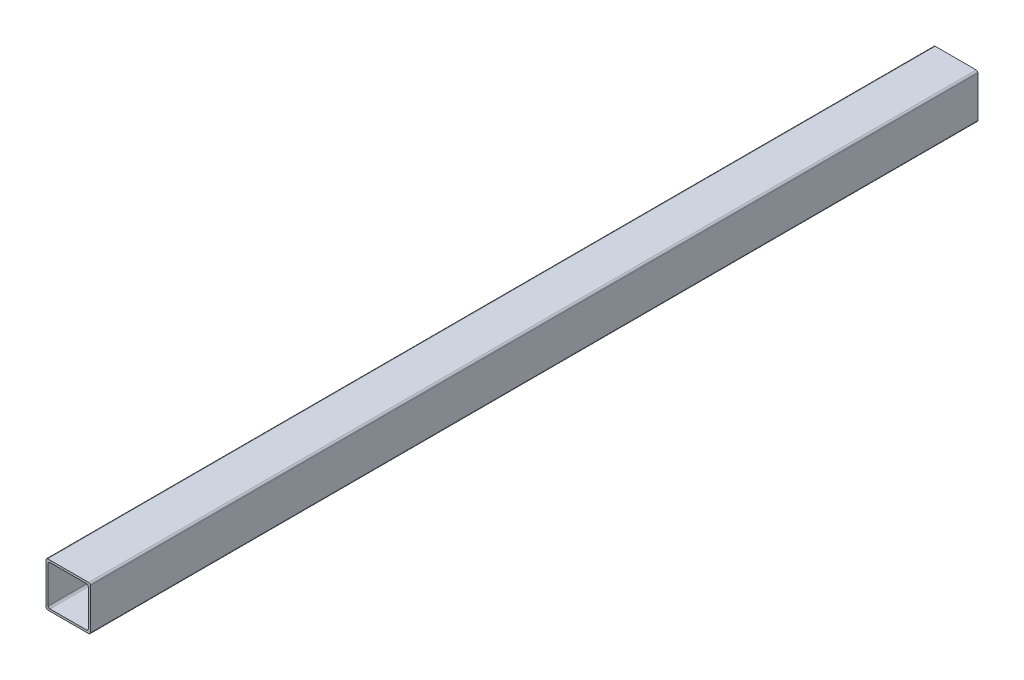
ISO-10303-21;
HEADER;
FILE_DESCRIPTION(('STEP AP214'),'2;1');
FILE_NAME('part.step','',(''),(''),'','','');
FILE_SCHEMA(('AUTOMOTIVE_DESIGN { 1 0 10303 214 1 1 1 1 }'));
ENDSEC;
DATA;
#1=APPLICATION_CONTEXT('core data for automotive mechanical design processes');
#2=APPLICATION_PROTOCOL_DEFINITION('international standard','automotive_design',2000,#1);
#3=PRODUCT_CONTEXT('',#1,'mechanical');
#4=PRODUCT('Part','Part','',(#3));
#5=PRODUCT_RELATED_PRODUCT_CATEGORY('part','',(#4));
#6=PRODUCT_DEFINITION_FORMATION('','',#4);
#7=PRODUCT_DEFINITION_CONTEXT('part definition',#1,'design');
#8=PRODUCT_DEFINITION('design','',#6,#7);
#9=PRODUCT_DEFINITION_SHAPE('','',#8);
#10=(LENGTH_UNIT() NAMED_UNIT(*) SI_UNIT(.MILLI.,.METRE.));
#11=(NAMED_UNIT(*) PLANE_ANGLE_UNIT() SI_UNIT($,.RADIAN.));
#12=(NAMED_UNIT(*) SI_UNIT($,.STERADIAN.) SOLID_ANGLE_UNIT());
#13=UNCERTAINTY_MEASURE_WITH_UNIT(LENGTH_MEASURE(1.E-05),#10,'distance_accuracy_value','');
#14=(GEOMETRIC_REPRESENTATION_CONTEXT(3) GLOBAL_UNCERTAINTY_ASSIGNED_CONTEXT((#13)) GLOBAL_UNIT_ASSIGNED_CONTEXT((#10,
#11,#12)) REPRESENTATION_CONTEXT('',''));
#15=CARTESIAN_POINT('',(0.,0.,0.));
#16=DIRECTION('',(0.,0.,1.));
#17=DIRECTION('',(1.,0.,0.));
#18=AXIS2_PLACEMENT_3D('',#15,#16,#17);
#19=CARTESIAN_POINT('',(11.537,11.537,500.));
#20=DIRECTION('',(0.,0.,-1.));
#21=DIRECTION('',(-1.,0.,0.));
#22=AXIS2_PLACEMENT_3D('',#19,#20,#21);
#23=PLANE('',#22);
#24=CARTESIAN_POINT('',(11.537,11.537,500.));
#25=DIRECTION('',(0.,0.,1.));
#26=DIRECTION('',(-1.,0.,0.));
#27=AXIS2_PLACEMENT_3D('',#24,#25,#26);
#28=CIRCLE('',#27,0.963000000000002);
#29=CARTESIAN_POINT('',(12.5,11.537,500.));
#30=VERTEX_POINT('',#29);
#31=CARTESIAN_POINT('',(11.537,12.5,500.));
#32=VERTEX_POINT('',#31);
#33=EDGE_CURVE('E210',#30,#32,#28,.T.);
#34=ORIENTED_EDGE('',*,*,#33,.T.);
#35=DIRECTION('',(-1.,0.,0.));
#36=VECTOR('',#35,1.);
#37=CARTESIAN_POINT('',(-11.537,12.5,500.));
#38=LINE('',#37,#36);
#39=CARTESIAN_POINT('',(-11.537,12.5,500.));
#40=VERTEX_POINT('',#39);
#41=EDGE_CURVE('E213',#32,#40,#38,.T.);
#42=ORIENTED_EDGE('',*,*,#41,.T.);
#43=CARTESIAN_POINT('',(-11.537,11.537,500.));
#44=DIRECTION('',(0.,0.,1.));
#45=DIRECTION('',(1.,0.,0.));
#46=AXIS2_PLACEMENT_3D('',#43,#44,#45);
#47=CIRCLE('',#46,0.963000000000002);
#48=CARTESIAN_POINT('',(-12.5,11.537,500.));
#49=VERTEX_POINT('',#48);
#50=EDGE_CURVE('E216',#40,#49,#47,.T.);
#51=ORIENTED_EDGE('',*,*,#50,.T.);
#52=DIRECTION('',(0.,-1.,0.));
#53=VECTOR('',#52,1.);
#54=CARTESIAN_POINT('',(-12.5,11.537,500.));
#55=LINE('',#54,#53);
#56=CARTESIAN_POINT('',(-12.5,-11.537,500.));
#57=VERTEX_POINT('',#56);
#58=EDGE_CURVE('E218',#49,#57,#55,.T.);
#59=ORIENTED_EDGE('',*,*,#58,.T.);
#60=CARTESIAN_POINT('',(-11.537,-11.537,500.));
#61=DIRECTION('',(0.,0.,1.));
#62=DIRECTION('',(1.,0.,0.));
#63=AXIS2_PLACEMENT_3D('',#60,#61,#62);
#64=CIRCLE('',#63,0.963000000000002);
#65=CARTESIAN_POINT('',(-11.537,-12.5,500.));
#66=VERTEX_POINT('',#65);
#67=EDGE_CURVE('E220',#57,#66,#64,.T.);
#68=ORIENTED_EDGE('',*,*,#67,.T.);
#69=DIRECTION('',(1.,0.,0.));
#70=VECTOR('',#69,1.);
#71=CARTESIAN_POINT('',(-11.537,-12.5,500.));
#72=LINE('',#71,#70);
#73=CARTESIAN_POINT('',(11.537,-12.5,500.));
#74=VERTEX_POINT('',#73);
#75=EDGE_CURVE('E222',#66,#74,#72,.T.);
#76=ORIENTED_EDGE('',*,*,#75,.T.);
#77=CARTESIAN_POINT('',(11.537,-11.537,500.));
#78=DIRECTION('',(0.,0.,1.));
#79=DIRECTION('',(1.,0.,0.));
#80=AXIS2_PLACEMENT_3D('',#77,#78,#79);
#81=CIRCLE('',#80,0.963000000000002);
#82=CARTESIAN_POINT('',(12.5,-11.537,500.));
#83=VERTEX_POINT('',#82);
#84=EDGE_CURVE('E224',#74,#83,#81,.T.);
#85=ORIENTED_EDGE('',*,*,#84,.T.);
#86=DIRECTION('',(0.,1.,0.));
#87=VECTOR('',#86,1.);
#88=CARTESIAN_POINT('',(12.5,11.537,500.));
#89=LINE('',#88,#87);
#90=EDGE_CURVE('E226',#83,#30,#89,.T.);
#91=ORIENTED_EDGE('',*,*,#90,.T.);
#92=EDGE_LOOP('',(#34,#42,#51,#59,#68,#76,#85,#91));
#93=FACE_BOUND('',#92,.T.);
#94=CARTESIAN_POINT('',(10.337,-10.337,500.));
#95=DIRECTION('',(0.,0.,1.));
#96=DIRECTION('',(1.,0.,0.));
#97=AXIS2_PLACEMENT_3D('',#94,#95,#96);
#98=CIRCLE('',#97,0.963);
#99=CARTESIAN_POINT('',(10.337,-11.3,500.));
#100=VERTEX_POINT('',#99);
#101=CARTESIAN_POINT('',(11.3,-10.337,500.));
#102=VERTEX_POINT('',#101);
#103=EDGE_CURVE('E145',#100,#102,#98,.T.);
#104=ORIENTED_EDGE('',*,*,#103,.F.);
#105=DIRECTION('',(1.,0.,0.));
#106=VECTOR('',#105,1.);
#107=CARTESIAN_POINT('',(-10.337,-11.3,500.));
#108=LINE('',#107,#106);
#109=CARTESIAN_POINT('',(-10.337,-11.3,500.));
#110=VERTEX_POINT('',#109);
#111=EDGE_CURVE('E178',#110,#100,#108,.T.);
#112=ORIENTED_EDGE('',*,*,#111,.F.);
#113=CARTESIAN_POINT('',(-10.337,-10.337,500.));
#114=DIRECTION('',(0.,0.,1.));
#115=DIRECTION('',(1.,0.,0.));
#116=AXIS2_PLACEMENT_3D('',#113,#114,#115);
#117=CIRCLE('',#116,0.963);
#118=CARTESIAN_POINT('',(-11.3,-10.337,500.));
#119=VERTEX_POINT('',#118);
#120=EDGE_CURVE('E176',#119,#110,#117,.T.);
#121=ORIENTED_EDGE('',*,*,#120,.F.);
#122=DIRECTION('',(0.,-1.,0.));
#123=VECTOR('',#122,1.);
#124=CARTESIAN_POINT('',(-11.3,10.337,500.));
#125=LINE('',#124,#123);
#126=CARTESIAN_POINT('',(-11.3,10.337,500.));
#127=VERTEX_POINT('',#126);
#128=EDGE_CURVE('E174',#127,#119,#125,.T.);
#129=ORIENTED_EDGE('',*,*,#128,.F.);
#130=CARTESIAN_POINT('',(-10.337,10.337,500.));
#131=DIRECTION('',(0.,0.,1.));
#132=DIRECTION('',(1.,0.,0.));
#133=AXIS2_PLACEMENT_3D('',#130,#131,#132);
#134=CIRCLE('',#133,0.963);
#135=CARTESIAN_POINT('',(-10.337,11.3,500.));
#136=VERTEX_POINT('',#135);
#137=EDGE_CURVE('E172',#136,#127,#134,.T.);
#138=ORIENTED_EDGE('',*,*,#137,.F.);
#139=DIRECTION('',(-1.,0.,0.));
#140=VECTOR('',#139,1.);
#141=CARTESIAN_POINT('',(-10.337,11.3,500.));
#142=LINE('',#141,#140);
#143=CARTESIAN_POINT('',(10.337,11.3,500.));
#144=VERTEX_POINT('',#143);
#145=EDGE_CURVE('E168',#144,#136,#142,.T.);
#146=ORIENTED_EDGE('',*,*,#145,.F.);
#147=CARTESIAN_POINT('',(10.337,10.337,500.));
#148=DIRECTION('',(0.,0.,1.));
#149=DIRECTION('',(-1.,0.,0.));
#150=AXIS2_PLACEMENT_3D('',#147,#148,#149);
#151=CIRCLE('',#150,0.963);
#152=CARTESIAN_POINT('',(11.3,10.337,500.));
#153=VERTEX_POINT('',#152);
#154=EDGE_CURVE('E166',#153,#144,#151,.T.);
#155=ORIENTED_EDGE('',*,*,#154,.F.);
#156=DIRECTION('',(0.,1.,0.));
#157=VECTOR('',#156,1.);
#158=CARTESIAN_POINT('',(11.3,10.337,500.));
#159=LINE('',#158,#157);
#160=EDGE_CURVE('E153',#102,#153,#159,.T.);
#161=ORIENTED_EDGE('',*,*,#160,.F.);
#162=EDGE_LOOP('',(#104,#112,#121,#129,#138,#146,#155,#161));
#163=FACE_BOUND('',#162,.T.);
#164=ADVANCED_FACE('F32',(#93,#163),#23,.F.);
#165=CARTESIAN_POINT('',(11.537,11.537,0.));
#166=DIRECTION('',(0.,0.,-1.));
#167=DIRECTION('',(-1.,0.,0.));
#168=AXIS2_PLACEMENT_3D('',#165,#166,#167);
#169=PLANE('',#168);
#170=CARTESIAN_POINT('',(11.537,11.537,0.));
#171=DIRECTION('',(0.,0.,1.));
#172=DIRECTION('',(-1.,0.,0.));
#173=AXIS2_PLACEMENT_3D('',#170,#171,#172);
#174=CIRCLE('',#173,0.963000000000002);
#175=CARTESIAN_POINT('',(12.5,11.537,0.));
#176=VERTEX_POINT('',#175);
#177=CARTESIAN_POINT('',(11.537,12.5,0.));
#178=VERTEX_POINT('',#177);
#179=EDGE_CURVE('E161',#176,#178,#174,.T.);
#180=ORIENTED_EDGE('',*,*,#179,.F.);
#181=DIRECTION('',(0.,1.,0.));
#182=VECTOR('',#181,1.);
#183=CARTESIAN_POINT('',(12.5,11.537,0.));
#184=LINE('',#183,#182);
#185=CARTESIAN_POINT('',(12.5,-11.537,0.));
#186=VERTEX_POINT('',#185);
#187=EDGE_CURVE('E214',#186,#176,#184,.T.);
#188=ORIENTED_EDGE('',*,*,#187,.F.);
#189=CARTESIAN_POINT('',(11.537,-11.537,0.));
#190=DIRECTION('',(0.,0.,1.));
#191=DIRECTION('',(1.,0.,0.));
#192=AXIS2_PLACEMENT_3D('',#189,#190,#191);
#193=CIRCLE('',#192,0.963000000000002);
#194=CARTESIAN_POINT('',(11.537,-12.5,0.));
#195=VERTEX_POINT('',#194);
#196=EDGE_CURVE('E241',#195,#186,#193,.T.);
#197=ORIENTED_EDGE('',*,*,#196,.F.);
#198=DIRECTION('',(1.,0.,0.));
#199=VECTOR('',#198,1.);
#200=CARTESIAN_POINT('',(-11.537,-12.5,0.));
#201=LINE('',#200,#199);
#202=CARTESIAN_POINT('',(-11.537,-12.5,0.));
#203=VERTEX_POINT('',#202);
#204=EDGE_CURVE('E239',#203,#195,#201,.T.);
#205=ORIENTED_EDGE('',*,*,#204,.F.);
#206=CARTESIAN_POINT('',(-11.537,-11.537,0.));
#207=DIRECTION('',(0.,0.,1.));
#208=DIRECTION('',(1.,0.,0.));
#209=AXIS2_PLACEMENT_3D('',#206,#207,#208);
#210=CIRCLE('',#209,0.963000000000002);
#211=CARTESIAN_POINT('',(-12.5,-11.537,0.));
#212=VERTEX_POINT('',#211);
#213=EDGE_CURVE('E237',#212,#203,#210,.T.);
#214=ORIENTED_EDGE('',*,*,#213,.F.);
#215=DIRECTION('',(0.,-1.,0.));
#216=VECTOR('',#215,1.);
#217=CARTESIAN_POINT('',(-12.5,11.537,0.));
#218=LINE('',#217,#216);
#219=CARTESIAN_POINT('',(-12.5,11.537,0.));
#220=VERTEX_POINT('',#219);
#221=EDGE_CURVE('E235',#220,#212,#218,.T.);
#222=ORIENTED_EDGE('',*,*,#221,.F.);
#223=CARTESIAN_POINT('',(-11.537,11.537,0.));
#224=DIRECTION('',(0.,0.,1.));
#225=DIRECTION('',(1.,0.,0.));
#226=AXIS2_PLACEMENT_3D('',#223,#224,#225);
#227=CIRCLE('',#226,0.963000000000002);
#228=CARTESIAN_POINT('',(-11.537,12.5,0.));
#229=VERTEX_POINT('',#228);
#230=EDGE_CURVE('E233',#229,#220,#227,.T.);
#231=ORIENTED_EDGE('',*,*,#230,.F.);
#232=DIRECTION('',(-1.,0.,0.));
#233=VECTOR('',#232,1.);
#234=CARTESIAN_POINT('',(-11.537,12.5,0.));
#235=LINE('',#234,#233);
#236=EDGE_CURVE('E231',#178,#229,#235,.T.);
#237=ORIENTED_EDGE('',*,*,#236,.F.);
#238=EDGE_LOOP('',(#180,#188,#197,#205,#214,#222,#231,#237));
#239=FACE_BOUND('',#238,.T.);
#240=DIRECTION('',(1.,0.,0.));
#241=VECTOR('',#240,1.);
#242=CARTESIAN_POINT('',(-10.337,-11.3,0.));
#243=LINE('',#242,#241);
#244=CARTESIAN_POINT('',(-10.337,-11.3,0.));
#245=VERTEX_POINT('',#244);
#246=CARTESIAN_POINT('',(10.337,-11.3,0.));
#247=VERTEX_POINT('',#246);
#248=EDGE_CURVE('E154',#245,#247,#243,.T.);
#249=ORIENTED_EDGE('',*,*,#248,.T.);
#250=CARTESIAN_POINT('',(10.337,-10.337,0.));
#251=DIRECTION('',(0.,0.,1.));
#252=DIRECTION('',(1.,0.,0.));
#253=AXIS2_PLACEMENT_3D('',#250,#251,#252);
#254=CIRCLE('',#253,0.963);
#255=CARTESIAN_POINT('',(11.3,-10.337,0.));
#256=VERTEX_POINT('',#255);
#257=EDGE_CURVE('E55',#247,#256,#254,.T.);
#258=ORIENTED_EDGE('',*,*,#257,.T.);
#259=DIRECTION('',(0.,1.,0.));
#260=VECTOR('',#259,1.);
#261=CARTESIAN_POINT('',(11.3,10.337,0.));
#262=LINE('',#261,#260);
#263=CARTESIAN_POINT('',(11.3,10.337,0.));
#264=VERTEX_POINT('',#263);
#265=EDGE_CURVE('E160',#256,#264,#262,.T.);
#266=ORIENTED_EDGE('',*,*,#265,.T.);
#267=CARTESIAN_POINT('',(10.337,10.337,0.));
#268=DIRECTION('',(0.,0.,1.));
#269=DIRECTION('',(-1.,0.,0.));
#270=AXIS2_PLACEMENT_3D('',#267,#268,#269);
#271=CIRCLE('',#270,0.963);
#272=CARTESIAN_POINT('',(10.337,11.3,0.));
#273=VERTEX_POINT('',#272);
#274=EDGE_CURVE('E182',#264,#273,#271,.T.);
#275=ORIENTED_EDGE('',*,*,#274,.T.);
#276=DIRECTION('',(-1.,0.,0.));
#277=VECTOR('',#276,1.);
#278=CARTESIAN_POINT('',(-10.337,11.3,0.));
#279=LINE('',#278,#277);
#280=CARTESIAN_POINT('',(-10.337,11.3,0.));
#281=VERTEX_POINT('',#280);
#282=EDGE_CURVE('E185',#273,#281,#279,.T.);
#283=ORIENTED_EDGE('',*,*,#282,.T.);
#284=CARTESIAN_POINT('',(-10.337,10.337,0.));
#285=DIRECTION('',(0.,0.,1.));
#286=DIRECTION('',(1.,0.,0.));
#287=AXIS2_PLACEMENT_3D('',#284,#285,#286);
#288=CIRCLE('',#287,0.963);
#289=CARTESIAN_POINT('',(-11.3,10.337,0.));
#290=VERTEX_POINT('',#289);
#291=EDGE_CURVE('E188',#281,#290,#288,.T.);
#292=ORIENTED_EDGE('',*,*,#291,.T.);
#293=DIRECTION('',(0.,-1.,0.));
#294=VECTOR('',#293,1.);
#295=CARTESIAN_POINT('',(-11.3,10.337,0.));
#296=LINE('',#295,#294);
#297=CARTESIAN_POINT('',(-11.3,-10.337,0.));
#298=VERTEX_POINT('',#297);
#299=EDGE_CURVE('E191',#290,#298,#296,.T.);
#300=ORIENTED_EDGE('',*,*,#299,.T.);
#301=CARTESIAN_POINT('',(-10.337,-10.337,0.));
#302=DIRECTION('',(0.,0.,1.));
#303=DIRECTION('',(1.,0.,0.));
#304=AXIS2_PLACEMENT_3D('',#301,#302,#303);
#305=CIRCLE('',#304,0.963);
#306=EDGE_CURVE('E194',#298,#245,#305,.T.);
#307=ORIENTED_EDGE('',*,*,#306,.T.);
#308=EDGE_LOOP('',(#249,#258,#266,#275,#283,#292,#300,#307));
#309=FACE_BOUND('',#308,.T.);
#310=ADVANCED_FACE('F271',(#239,#309),#169,.T.);
#311=CARTESIAN_POINT('',(11.537,11.537,500.));
#312=DIRECTION('',(0.,0.,-1.));
#313=DIRECTION('',(-1.,0.,0.));
#314=AXIS2_PLACEMENT_3D('',#311,#312,#313);
#315=CYLINDRICAL_SURFACE('',#314,0.963000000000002);
#316=ORIENTED_EDGE('',*,*,#179,.T.);
#317=DIRECTION('',(0.,0.,-1.));
#318=VECTOR('',#317,1.);
#319=CARTESIAN_POINT('',(11.537,12.5,500.));
#320=LINE('',#319,#318);
#321=EDGE_CURVE('E11',#32,#178,#320,.T.);
#322=ORIENTED_EDGE('',*,*,#321,.F.);
#323=ORIENTED_EDGE('',*,*,#33,.F.);
#324=DIRECTION('',(0.,0.,-1.));
#325=VECTOR('',#324,1.);
#326=CARTESIAN_POINT('',(12.5,11.537,500.));
#327=LINE('',#326,#325);
#328=EDGE_CURVE('E228',#30,#176,#327,.T.);
#329=ORIENTED_EDGE('',*,*,#328,.T.);
#330=EDGE_LOOP('',(#316,#322,#323,#329));
#331=FACE_BOUND('',#330,.T.);
#332=ADVANCED_FACE('F34',(#331),#315,.T.);
#333=CARTESIAN_POINT('',(-11.537,12.5,500.));
#334=DIRECTION('',(0.,-1.,0.));
#335=DIRECTION('',(0.,0.,-1.));
#336=AXIS2_PLACEMENT_3D('',#333,#334,#335);
#337=PLANE('',#336);
#338=ORIENTED_EDGE('',*,*,#236,.T.);
#339=DIRECTION('',(0.,0.,-1.));
#340=VECTOR('',#339,1.);
#341=CARTESIAN_POINT('',(-11.537,12.5,500.));
#342=LINE('',#341,#340);
#343=EDGE_CURVE('E40',#40,#229,#342,.T.);
#344=ORIENTED_EDGE('',*,*,#343,.F.);
#345=ORIENTED_EDGE('',*,*,#41,.F.);
#346=ORIENTED_EDGE('',*,*,#321,.T.);
#347=EDGE_LOOP('',(#338,#344,#345,#346));
#348=FACE_BOUND('',#347,.T.);
#349=ADVANCED_FACE('F288',(#348),#337,.F.);
#350=CARTESIAN_POINT('',(-11.537,11.537,500.));
#351=DIRECTION('',(0.,0.,-1.));
#352=DIRECTION('',(-1.,0.,0.));
#353=AXIS2_PLACEMENT_3D('',#350,#351,#352);
#354=CYLINDRICAL_SURFACE('',#353,0.963000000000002);
#355=ORIENTED_EDGE('',*,*,#230,.T.);
#356=DIRECTION('',(0.,0.,-1.));
#357=VECTOR('',#356,1.);
#358=CARTESIAN_POINT('',(-12.5,11.537,500.));
#359=LINE('',#358,#357);
#360=EDGE_CURVE('E258',#49,#220,#359,.T.);
#361=ORIENTED_EDGE('',*,*,#360,.F.);
#362=ORIENTED_EDGE('',*,*,#50,.F.);
#363=ORIENTED_EDGE('',*,*,#343,.T.);
#364=EDGE_LOOP('',(#355,#361,#362,#363));
#365=FACE_BOUND('',#364,.T.);
#366=ADVANCED_FACE('F265',(#365),#354,.T.);
#367=CARTESIAN_POINT('',(-12.5,11.537,500.));
#368=DIRECTION('',(1.,0.,0.));
#369=DIRECTION('',(0.,0.,-1.));
#370=AXIS2_PLACEMENT_3D('',#367,#368,#369);
#371=PLANE('',#370);
#372=ORIENTED_EDGE('',*,*,#221,.T.);
#373=DIRECTION('',(0.,0.,-1.));
#374=VECTOR('',#373,1.);
#375=CARTESIAN_POINT('',(-12.5,-11.537,500.));
#376=LINE('',#375,#374);
#377=EDGE_CURVE('E255',#57,#212,#376,.T.);
#378=ORIENTED_EDGE('',*,*,#377,.F.);
#379=ORIENTED_EDGE('',*,*,#58,.F.);
#380=ORIENTED_EDGE('',*,*,#360,.T.);
#381=EDGE_LOOP('',(#372,#378,#379,#380));
#382=FACE_BOUND('',#381,.T.);
#383=ADVANCED_FACE('F277',(#382),#371,.F.);
#384=CARTESIAN_POINT('',(-11.537,-11.537,500.));
#385=DIRECTION('',(0.,0.,-1.));
#386=DIRECTION('',(-1.,0.,0.));
#387=AXIS2_PLACEMENT_3D('',#384,#385,#386);
#388=CYLINDRICAL_SURFACE('',#387,0.963000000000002);
#389=ORIENTED_EDGE('',*,*,#213,.T.);
#390=DIRECTION('',(0.,0.,-1.));
#391=VECTOR('',#390,1.);
#392=CARTESIAN_POINT('',(-11.537,-12.5,500.));
#393=LINE('',#392,#391);
#394=EDGE_CURVE('E252',#66,#203,#393,.T.);
#395=ORIENTED_EDGE('',*,*,#394,.F.);
#396=ORIENTED_EDGE('',*,*,#67,.F.);
#397=ORIENTED_EDGE('',*,*,#377,.T.);
#398=EDGE_LOOP('',(#389,#395,#396,#397));
#399=FACE_BOUND('',#398,.T.);
#400=ADVANCED_FACE('F281',(#399),#388,.T.);
#401=CARTESIAN_POINT('',(-11.537,-12.5,500.));
#402=DIRECTION('',(0.,1.,0.));
#403=DIRECTION('',(0.,0.,1.));
#404=AXIS2_PLACEMENT_3D('',#401,#402,#403);
#405=PLANE('',#404);
#406=ORIENTED_EDGE('',*,*,#204,.T.);
#407=DIRECTION('',(0.,0.,-1.));
#408=VECTOR('',#407,1.);
#409=CARTESIAN_POINT('',(11.537,-12.5,500.));
#410=LINE('',#409,#408);
#411=EDGE_CURVE('E249',#74,#195,#410,.T.);
#412=ORIENTED_EDGE('',*,*,#411,.F.);
#413=ORIENTED_EDGE('',*,*,#75,.F.);
#414=ORIENTED_EDGE('',*,*,#394,.T.);
#415=EDGE_LOOP('',(#406,#412,#413,#414));
#416=FACE_BOUND('',#415,.T.);
#417=ADVANCED_FACE('F301',(#416),#405,.F.);
#418=CARTESIAN_POINT('',(11.537,-11.537,500.));
#419=DIRECTION('',(0.,0.,-1.));
#420=DIRECTION('',(-1.,0.,0.));
#421=AXIS2_PLACEMENT_3D('',#418,#419,#420);
#422=CYLINDRICAL_SURFACE('',#421,0.963000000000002);
#423=ORIENTED_EDGE('',*,*,#196,.T.);
#424=DIRECTION('',(0.,0.,-1.));
#425=VECTOR('',#424,1.);
#426=CARTESIAN_POINT('',(12.5,-11.537,500.));
#427=LINE('',#426,#425);
#428=EDGE_CURVE('E246',#83,#186,#427,.T.);
#429=ORIENTED_EDGE('',*,*,#428,.F.);
#430=ORIENTED_EDGE('',*,*,#84,.F.);
#431=ORIENTED_EDGE('',*,*,#411,.T.);
#432=EDGE_LOOP('',(#423,#429,#430,#431));
#433=FACE_BOUND('',#432,.T.);
#434=ADVANCED_FACE('F299',(#433),#422,.T.);
#435=CARTESIAN_POINT('',(12.5,11.537,500.));
#436=DIRECTION('',(-1.,0.,0.));
#437=DIRECTION('',(0.,0.,1.));
#438=AXIS2_PLACEMENT_3D('',#435,#436,#437);
#439=PLANE('',#438);
#440=ORIENTED_EDGE('',*,*,#187,.T.);
#441=ORIENTED_EDGE('',*,*,#328,.F.);
#442=ORIENTED_EDGE('',*,*,#90,.F.);
#443=ORIENTED_EDGE('',*,*,#428,.T.);
#444=EDGE_LOOP('',(#440,#441,#442,#443));
#445=FACE_BOUND('',#444,.T.);
#446=ADVANCED_FACE('F294',(#445),#439,.F.);
#447=CARTESIAN_POINT('',(10.337,-10.337,500.));
#448=DIRECTION('',(0.,0.,-1.));
#449=DIRECTION('',(-1.,0.,0.));
#450=AXIS2_PLACEMENT_3D('',#447,#448,#449);
#451=CYLINDRICAL_SURFACE('',#450,0.963);
#452=ORIENTED_EDGE('',*,*,#257,.F.);
#453=DIRECTION('',(0.,0.,-1.));
#454=VECTOR('',#453,1.);
#455=CARTESIAN_POINT('',(10.337,-11.3,500.));
#456=LINE('',#455,#454);
#457=EDGE_CURVE('E149',#100,#247,#456,.T.);
#458=ORIENTED_EDGE('',*,*,#457,.F.);
#459=ORIENTED_EDGE('',*,*,#103,.T.);
#460=DIRECTION('',(0.,0.,-1.));
#461=VECTOR('',#460,1.);
#462=CARTESIAN_POINT('',(11.3,-10.337,500.));
#463=LINE('',#462,#461);
#464=EDGE_CURVE('E148',#102,#256,#463,.T.);
#465=ORIENTED_EDGE('',*,*,#464,.T.);
#466=EDGE_LOOP('',(#452,#458,#459,#465));
#467=FACE_BOUND('',#466,.T.);
#468=ADVANCED_FACE('F147',(#467),#451,.F.);
#469=CARTESIAN_POINT('',(11.3,10.337,500.));
#470=DIRECTION('',(-1.,0.,0.));
#471=DIRECTION('',(0.,0.,1.));
#472=AXIS2_PLACEMENT_3D('',#469,#470,#471);
#473=PLANE('',#472);
#474=ORIENTED_EDGE('',*,*,#265,.F.);
#475=ORIENTED_EDGE('',*,*,#464,.F.);
#476=ORIENTED_EDGE('',*,*,#160,.T.);
#477=DIRECTION('',(0.,0.,-1.));
#478=VECTOR('',#477,1.);
#479=CARTESIAN_POINT('',(11.3,10.337,500.));
#480=LINE('',#479,#478);
#481=EDGE_CURVE('E162',#153,#264,#480,.T.);
#482=ORIENTED_EDGE('',*,*,#481,.T.);
#483=EDGE_LOOP('',(#474,#475,#476,#482));
#484=FACE_BOUND('',#483,.T.);
#485=ADVANCED_FACE('F157',(#484),#473,.T.);
#486=CARTESIAN_POINT('',(10.337,10.337,500.));
#487=DIRECTION('',(0.,0.,-1.));
#488=DIRECTION('',(-1.,0.,0.));
#489=AXIS2_PLACEMENT_3D('',#486,#487,#488);
#490=CYLINDRICAL_SURFACE('',#489,0.963);
#491=ORIENTED_EDGE('',*,*,#274,.F.);
#492=ORIENTED_EDGE('',*,*,#481,.F.);
#493=ORIENTED_EDGE('',*,*,#154,.T.);
#494=DIRECTION('',(0.,0.,-1.));
#495=VECTOR('',#494,1.);
#496=CARTESIAN_POINT('',(10.337,11.3,500.));
#497=LINE('',#496,#495);
#498=EDGE_CURVE('E207',#144,#273,#497,.T.);
#499=ORIENTED_EDGE('',*,*,#498,.T.);
#500=EDGE_LOOP('',(#491,#492,#493,#499));
#501=FACE_BOUND('',#500,.T.);
#502=ADVANCED_FACE('F326',(#501),#490,.F.);
#503=CARTESIAN_POINT('',(-10.337,11.3,500.));
#504=DIRECTION('',(0.,-1.,0.));
#505=DIRECTION('',(0.,0.,-1.));
#506=AXIS2_PLACEMENT_3D('',#503,#504,#505);
#507=PLANE('',#506);
#508=ORIENTED_EDGE('',*,*,#282,.F.);
#509=ORIENTED_EDGE('',*,*,#498,.F.);
#510=ORIENTED_EDGE('',*,*,#145,.T.);
#511=DIRECTION('',(0.,0.,-1.));
#512=VECTOR('',#511,1.);
#513=CARTESIAN_POINT('',(-10.337,11.3,500.));
#514=LINE('',#513,#512);
#515=EDGE_CURVE('E205',#136,#281,#514,.T.);
#516=ORIENTED_EDGE('',*,*,#515,.T.);
#517=EDGE_LOOP('',(#508,#509,#510,#516));
#518=FACE_BOUND('',#517,.T.);
#519=ADVANCED_FACE('F330',(#518),#507,.T.);
#520=CARTESIAN_POINT('',(-10.337,10.337,500.));
#521=DIRECTION('',(0.,0.,-1.));
#522=DIRECTION('',(-1.,0.,0.));
#523=AXIS2_PLACEMENT_3D('',#520,#521,#522);
#524=CYLINDRICAL_SURFACE('',#523,0.963);
#525=ORIENTED_EDGE('',*,*,#291,.F.);
#526=ORIENTED_EDGE('',*,*,#515,.F.);
#527=ORIENTED_EDGE('',*,*,#137,.T.);
#528=DIRECTION('',(0.,0.,-1.));
#529=VECTOR('',#528,1.);
#530=CARTESIAN_POINT('',(-11.3,10.337,500.));
#531=LINE('',#530,#529);
#532=EDGE_CURVE('E203',#127,#290,#531,.T.);
#533=ORIENTED_EDGE('',*,*,#532,.T.);
#534=EDGE_LOOP('',(#525,#526,#527,#533));
#535=FACE_BOUND('',#534,.T.);
#536=ADVANCED_FACE('F336',(#535),#524,.F.);
#537=CARTESIAN_POINT('',(-11.3,10.337,500.));
#538=DIRECTION('',(1.,0.,0.));
#539=DIRECTION('',(0.,0.,-1.));
#540=AXIS2_PLACEMENT_3D('',#537,#538,#539);
#541=PLANE('',#540);
#542=ORIENTED_EDGE('',*,*,#299,.F.);
#543=ORIENTED_EDGE('',*,*,#532,.F.);
#544=ORIENTED_EDGE('',*,*,#128,.T.);
#545=DIRECTION('',(0.,0.,-1.));
#546=VECTOR('',#545,1.);
#547=CARTESIAN_POINT('',(-11.3,-10.337,500.));
#548=LINE('',#547,#546);
#549=EDGE_CURVE('E201',#119,#298,#548,.T.);
#550=ORIENTED_EDGE('',*,*,#549,.T.);
#551=EDGE_LOOP('',(#542,#543,#544,#550));
#552=FACE_BOUND('',#551,.T.);
#553=ADVANCED_FACE('F340',(#552),#541,.T.);
#554=CARTESIAN_POINT('',(-10.337,-10.337,500.));
#555=DIRECTION('',(0.,0.,-1.));
#556=DIRECTION('',(-1.,0.,0.));
#557=AXIS2_PLACEMENT_3D('',#554,#555,#556);
#558=CYLINDRICAL_SURFACE('',#557,0.963);
#559=ORIENTED_EDGE('',*,*,#306,.F.);
#560=ORIENTED_EDGE('',*,*,#549,.F.);
#561=ORIENTED_EDGE('',*,*,#120,.T.);
#562=DIRECTION('',(0.,0.,-1.));
#563=VECTOR('',#562,1.);
#564=CARTESIAN_POINT('',(-10.337,-11.3,500.));
#565=LINE('',#564,#563);
#566=EDGE_CURVE('E47',#110,#245,#565,.T.);
#567=ORIENTED_EDGE('',*,*,#566,.T.);
#568=EDGE_LOOP('',(#559,#560,#561,#567));
#569=FACE_BOUND('',#568,.T.);
#570=ADVANCED_FACE('F344',(#569),#558,.F.);
#571=CARTESIAN_POINT('',(-10.337,-11.3,500.));
#572=DIRECTION('',(0.,1.,0.));
#573=DIRECTION('',(0.,0.,1.));
#574=AXIS2_PLACEMENT_3D('',#571,#572,#573);
#575=PLANE('',#574);
#576=ORIENTED_EDGE('',*,*,#248,.F.);
#577=ORIENTED_EDGE('',*,*,#566,.F.);
#578=ORIENTED_EDGE('',*,*,#111,.T.);
#579=ORIENTED_EDGE('',*,*,#457,.T.);
#580=EDGE_LOOP('',(#576,#577,#578,#579));
#581=FACE_BOUND('',#580,.T.);
#582=ADVANCED_FACE('F348',(#581),#575,.T.);
#583=CLOSED_SHELL('',(#164,#310,#332,#349,#366,#383,#400,#417,#434,#446,#468,#485,#502,#519,
#536,#553,#570,#582));
#584=MANIFOLD_SOLID_BREP('B2',#583);
#585=ADVANCED_BREP_SHAPE_REPRESENTATION('',(#18,#584),#14);
#586=SHAPE_DEFINITION_REPRESENTATION(#9,#585);
ENDSEC;
END-ISO-10303-21;
